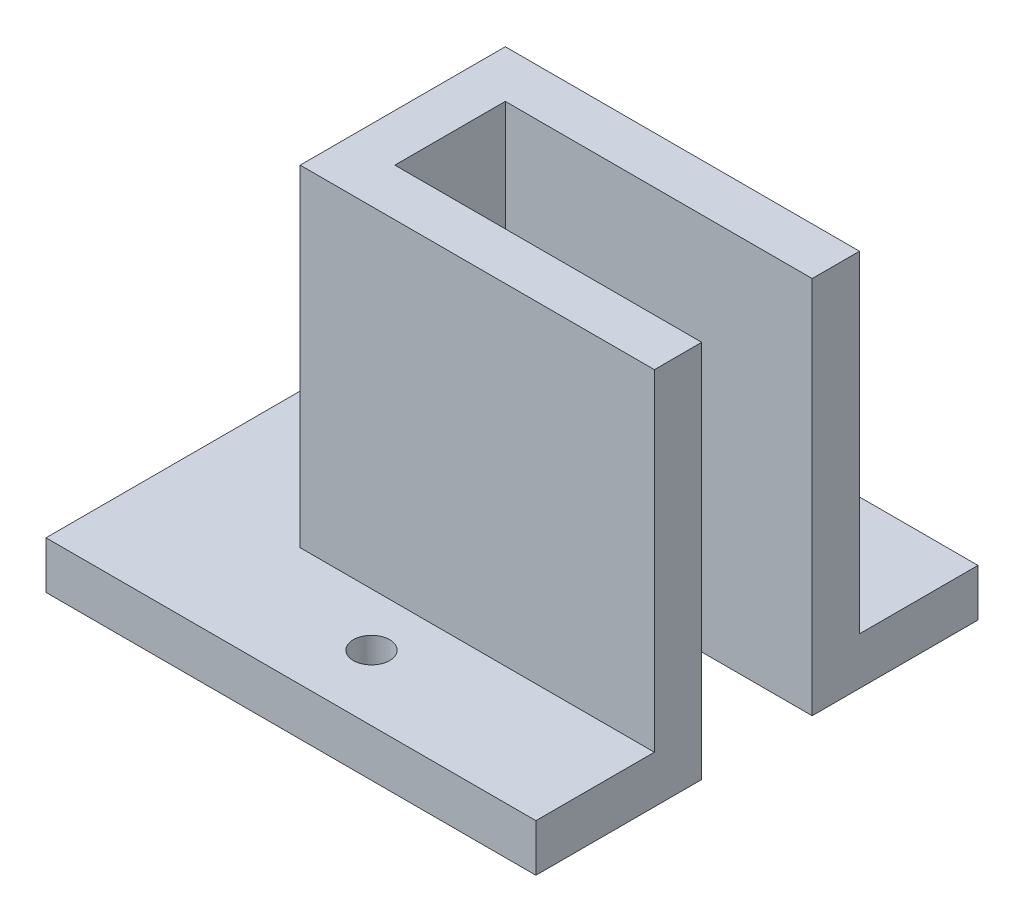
ISO-10303-21;
HEADER;
FILE_DESCRIPTION(('STEP AP214'),'2;1');
FILE_NAME('part.step','',(''),(''),'','','');
FILE_SCHEMA(('AUTOMOTIVE_DESIGN { 1 0 10303 214 1 1 1 1 }'));
ENDSEC;
DATA;
#1=APPLICATION_CONTEXT('core data for automotive mechanical design processes');
#2=APPLICATION_PROTOCOL_DEFINITION('international standard','automotive_design',2000,#1);
#3=PRODUCT_CONTEXT('',#1,'mechanical');
#4=PRODUCT('Part','Part','',(#3));
#5=PRODUCT_RELATED_PRODUCT_CATEGORY('part','',(#4));
#6=PRODUCT_DEFINITION_FORMATION('','',#4);
#7=PRODUCT_DEFINITION_CONTEXT('part definition',#1,'design');
#8=PRODUCT_DEFINITION('design','',#6,#7);
#9=PRODUCT_DEFINITION_SHAPE('','',#8);
#10=(LENGTH_UNIT() NAMED_UNIT(*) SI_UNIT(.MILLI.,.METRE.));
#11=(NAMED_UNIT(*) PLANE_ANGLE_UNIT() SI_UNIT($,.RADIAN.));
#12=(NAMED_UNIT(*) SI_UNIT($,.STERADIAN.) SOLID_ANGLE_UNIT());
#13=UNCERTAINTY_MEASURE_WITH_UNIT(LENGTH_MEASURE(1.E-05),#10,'distance_accuracy_value','');
#14=(GEOMETRIC_REPRESENTATION_CONTEXT(3) GLOBAL_UNCERTAINTY_ASSIGNED_CONTEXT((#13)) GLOBAL_UNIT_ASSIGNED_CONTEXT((#10,
#11,#12)) REPRESENTATION_CONTEXT('',''));
#15=CARTESIAN_POINT('',(0.,0.,0.));
#16=DIRECTION('',(0.,0.,1.));
#17=DIRECTION('',(1.,0.,0.));
#18=AXIS2_PLACEMENT_3D('',#15,#16,#17);
#19=CARTESIAN_POINT('',(0.,24.,13.));
#20=DIRECTION('',(0.,0.,-1.));
#21=DIRECTION('',(-1.,0.,0.));
#22=AXIS2_PLACEMENT_3D('',#19,#20,#21);
#23=PLANE('',#22);
#24=DIRECTION('',(-1.,0.,0.));
#25=VECTOR('',#24,1.);
#26=CARTESIAN_POINT('',(-8.6,3.,13.));
#27=LINE('',#26,#25);
#28=CARTESIAN_POINT('',(22.45,3.,13.));
#29=VERTEX_POINT('',#28);
#30=CARTESIAN_POINT('',(0.,3.,13.));
#31=VERTEX_POINT('',#30);
#32=EDGE_CURVE('E69',#29,#31,#27,.T.);
#33=ORIENTED_EDGE('',*,*,#32,.F.);
#34=DIRECTION('',(0.,-1.,0.));
#35=VECTOR('',#34,1.);
#36=CARTESIAN_POINT('',(22.45,24.,13.));
#37=LINE('',#36,#35);
#38=CARTESIAN_POINT('',(22.45,24.,13.));
#39=VERTEX_POINT('',#38);
#40=EDGE_CURVE('E54',#39,#29,#37,.T.);
#41=ORIENTED_EDGE('',*,*,#40,.F.);
#42=DIRECTION('',(1.,0.,0.));
#43=VECTOR('',#42,1.);
#44=CARTESIAN_POINT('',(0.,24.,13.));
#45=LINE('',#44,#43);
#46=CARTESIAN_POINT('',(0.,24.,13.));
#47=VERTEX_POINT('',#46);
#48=EDGE_CURVE('E256',#47,#39,#45,.T.);
#49=ORIENTED_EDGE('',*,*,#48,.F.);
#50=DIRECTION('',(0.,-1.,0.));
#51=VECTOR('',#50,1.);
#52=CARTESIAN_POINT('',(0.,24.,13.));
#53=LINE('',#52,#51);
#54=EDGE_CURVE('E11',#47,#31,#53,.T.);
#55=ORIENTED_EDGE('',*,*,#54,.T.);
#56=EDGE_LOOP('',(#33,#41,#49,#55));
#57=FACE_BOUND('',#56,.T.);
#58=ADVANCED_FACE('F45',(#57),#23,.F.);
#59=CARTESIAN_POINT('',(0.,24.,0.));
#60=DIRECTION('',(1.,0.,0.));
#61=DIRECTION('',(0.,0.,-1.));
#62=AXIS2_PLACEMENT_3D('',#59,#60,#61);
#63=PLANE('',#62);
#64=DIRECTION('',(0.,0.,-1.));
#65=VECTOR('',#64,1.);
#66=CARTESIAN_POINT('',(0.,3.,0.));
#67=LINE('',#66,#65);
#68=CARTESIAN_POINT('',(0.,3.,0.));
#69=VERTEX_POINT('',#68);
#70=EDGE_CURVE('E209',#31,#69,#67,.T.);
#71=ORIENTED_EDGE('',*,*,#70,.F.);
#72=ORIENTED_EDGE('',*,*,#54,.F.);
#73=DIRECTION('',(0.,0.,1.));
#74=VECTOR('',#73,1.);
#75=CARTESIAN_POINT('',(0.,24.,0.));
#76=LINE('',#75,#74);
#77=CARTESIAN_POINT('',(0.,24.,0.));
#78=VERTEX_POINT('',#77);
#79=EDGE_CURVE('E252',#78,#47,#76,.T.);
#80=ORIENTED_EDGE('',*,*,#79,.F.);
#81=DIRECTION('',(0.,-1.,0.));
#82=VECTOR('',#81,1.);
#83=CARTESIAN_POINT('',(0.,24.,0.));
#84=LINE('',#83,#82);
#85=EDGE_CURVE('E268',#78,#69,#84,.T.);
#86=ORIENTED_EDGE('',*,*,#85,.T.);
#87=EDGE_LOOP('',(#71,#72,#80,#86));
#88=FACE_BOUND('',#87,.T.);
#89=ADVANCED_FACE('F47',(#88),#63,.F.);
#90=CARTESIAN_POINT('',(22.45,24.,0.));
#91=DIRECTION('',(-1.,0.,0.));
#92=DIRECTION('',(0.,0.,1.));
#93=AXIS2_PLACEMENT_3D('',#90,#91,#92);
#94=PLANE('',#93);
#95=DIRECTION('',(0.,-1.,0.));
#96=VECTOR('',#95,1.);
#97=CARTESIAN_POINT('',(22.45,24.,10.));
#98=LINE('',#97,#96);
#99=CARTESIAN_POINT('',(22.45,24.,10.));
#100=VERTEX_POINT('',#99);
#101=CARTESIAN_POINT('',(22.45,0.,10.));
#102=VERTEX_POINT('',#101);
#103=EDGE_CURVE('E248',#100,#102,#98,.T.);
#104=ORIENTED_EDGE('',*,*,#103,.F.);
#105=DIRECTION('',(0.,0.,-1.));
#106=VECTOR('',#105,1.);
#107=CARTESIAN_POINT('',(22.45,24.,0.));
#108=LINE('',#107,#106);
#109=EDGE_CURVE('E261',#39,#100,#108,.T.);
#110=ORIENTED_EDGE('',*,*,#109,.F.);
#111=ORIENTED_EDGE('',*,*,#40,.T.);
#112=DIRECTION('',(0.,0.,-1.));
#113=VECTOR('',#112,1.);
#114=CARTESIAN_POINT('',(22.45,3.,20.51));
#115=LINE('',#114,#113);
#116=CARTESIAN_POINT('',(22.45,3.,20.51));
#117=VERTEX_POINT('',#116);
#118=EDGE_CURVE('E199',#117,#29,#115,.T.);
#119=ORIENTED_EDGE('',*,*,#118,.F.);
#120=DIRECTION('',(0.,1.,0.));
#121=VECTOR('',#120,1.);
#122=CARTESIAN_POINT('',(22.45,0.,20.51));
#123=LINE('',#122,#121);
#124=CARTESIAN_POINT('',(22.45,0.,20.51));
#125=VERTEX_POINT('',#124);
#126=EDGE_CURVE('E193',#125,#117,#123,.T.);
#127=ORIENTED_EDGE('',*,*,#126,.F.);
#128=DIRECTION('',(0.,0.,-1.));
#129=VECTOR('',#128,1.);
#130=CARTESIAN_POINT('',(22.45,0.,0.));
#131=LINE('',#130,#129);
#132=EDGE_CURVE('E257',#125,#102,#131,.T.);
#133=ORIENTED_EDGE('',*,*,#132,.T.);
#134=EDGE_LOOP('',(#104,#110,#111,#119,#127,#133));
#135=FACE_BOUND('',#134,.T.);
#136=ADVANCED_FACE('F283',(#135),#94,.F.);
#137=CARTESIAN_POINT('',(0.,24.,0.));
#138=DIRECTION('',(0.,1.,0.));
#139=DIRECTION('',(0.,0.,1.));
#140=AXIS2_PLACEMENT_3D('',#137,#138,#139);
#141=PLANE('',#140);
#142=ORIENTED_EDGE('',*,*,#109,.T.);
#143=DIRECTION('',(1.,0.,0.));
#144=VECTOR('',#143,1.);
#145=CARTESIAN_POINT('',(0.,24.,10.));
#146=LINE('',#145,#144);
#147=CARTESIAN_POINT('',(3.,24.,10.));
#148=VERTEX_POINT('',#147);
#149=EDGE_CURVE('E217',#148,#100,#146,.T.);
#150=ORIENTED_EDGE('',*,*,#149,.F.);
#151=DIRECTION('',(0.,0.,1.));
#152=VECTOR('',#151,1.);
#153=CARTESIAN_POINT('',(3.,24.,0.));
#154=LINE('',#153,#152);
#155=CARTESIAN_POINT('',(3.,24.,3.));
#156=VERTEX_POINT('',#155);
#157=EDGE_CURVE('E225',#156,#148,#154,.T.);
#158=ORIENTED_EDGE('',*,*,#157,.F.);
#159=DIRECTION('',(1.,0.,0.));
#160=VECTOR('',#159,1.);
#161=CARTESIAN_POINT('',(0.,24.,3.));
#162=LINE('',#161,#160);
#163=CARTESIAN_POINT('',(22.45,24.,3.));
#164=VERTEX_POINT('',#163);
#165=EDGE_CURVE('E220',#156,#164,#162,.T.);
#166=ORIENTED_EDGE('',*,*,#165,.T.);
#167=CARTESIAN_POINT('',(22.45,24.,0.));
#168=VERTEX_POINT('',#167);
#169=EDGE_CURVE('E260',#164,#168,#108,.T.);
#170=ORIENTED_EDGE('',*,*,#169,.T.);
#171=DIRECTION('',(-1.,0.,0.));
#172=VECTOR('',#171,1.);
#173=CARTESIAN_POINT('',(0.,24.,0.));
#174=LINE('',#173,#172);
#175=EDGE_CURVE('E265',#168,#78,#174,.T.);
#176=ORIENTED_EDGE('',*,*,#175,.T.);
#177=ORIENTED_EDGE('',*,*,#79,.T.);
#178=ORIENTED_EDGE('',*,*,#48,.T.);
#179=EDGE_LOOP('',(#142,#150,#158,#166,#170,#176,#177,#178));
#180=FACE_BOUND('',#179,.T.);
#181=ADVANCED_FACE('F292',(#180),#141,.T.);
#182=CARTESIAN_POINT('',(0.,0.,0.));
#183=DIRECTION('',(0.,1.,0.));
#184=DIRECTION('',(0.,0.,1.));
#185=AXIS2_PLACEMENT_3D('',#182,#183,#184);
#186=PLANE('',#185);
#187=CARTESIAN_POINT('',(8.12,0.,-3.64));
#188=DIRECTION('',(0.,1.,0.));
#189=DIRECTION('',(0.,0.,1.));
#190=AXIS2_PLACEMENT_3D('',#187,#188,#189);
#191=CIRCLE('',#190,1.15);
#192=CARTESIAN_POINT('',(8.12,0.,-2.49));
#193=VERTEX_POINT('',#192);
#194=EDGE_CURVE('E176',#193,#193,#191,.T.);
#195=ORIENTED_EDGE('',*,*,#194,.T.);
#196=EDGE_LOOP('',(#195));
#197=FACE_BOUND('',#196,.T.);
#198=CARTESIAN_POINT('',(7.88,0.,16.36));
#199=DIRECTION('',(0.,1.,0.));
#200=DIRECTION('',(0.,0.,1.));
#201=AXIS2_PLACEMENT_3D('',#198,#199,#200);
#202=CIRCLE('',#201,1.15);
#203=CARTESIAN_POINT('',(7.88,0.,17.51));
#204=VERTEX_POINT('',#203);
#205=EDGE_CURVE('E180',#204,#204,#202,.T.);
#206=ORIENTED_EDGE('',*,*,#205,.T.);
#207=EDGE_LOOP('',(#206));
#208=FACE_BOUND('',#207,.T.);
#209=CARTESIAN_POINT('',(-4.25,0.,6.22));
#210=DIRECTION('',(0.,1.,0.));
#211=DIRECTION('',(0.,0.,1.));
#212=AXIS2_PLACEMENT_3D('',#209,#210,#211);
#213=CIRCLE('',#212,1.15);
#214=CARTESIAN_POINT('',(-4.25,0.,7.37));
#215=VERTEX_POINT('',#214);
#216=EDGE_CURVE('E205',#215,#215,#213,.T.);
#217=ORIENTED_EDGE('',*,*,#216,.T.);
#218=EDGE_LOOP('',(#217));
#219=FACE_BOUND('',#218,.T.);
#220=DIRECTION('',(1.,0.,0.));
#221=VECTOR('',#220,1.);
#222=CARTESIAN_POINT('',(0.,0.,10.));
#223=LINE('',#222,#221);
#224=CARTESIAN_POINT('',(3.,0.,10.));
#225=VERTEX_POINT('',#224);
#226=EDGE_CURVE('E148',#225,#102,#223,.T.);
#227=ORIENTED_EDGE('',*,*,#226,.T.);
#228=ORIENTED_EDGE('',*,*,#132,.F.);
#229=DIRECTION('',(1.,0.,0.));
#230=VECTOR('',#229,1.);
#231=CARTESIAN_POINT('',(-8.6,0.,20.51));
#232=LINE('',#231,#230);
#233=CARTESIAN_POINT('',(-8.6,0.,20.51));
#234=VERTEX_POINT('',#233);
#235=EDGE_CURVE('E189',#234,#125,#232,.T.);
#236=ORIENTED_EDGE('',*,*,#235,.F.);
#237=DIRECTION('',(0.,0.,1.));
#238=VECTOR('',#237,1.);
#239=CARTESIAN_POINT('',(-8.6,0.,0.));
#240=LINE('',#239,#238);
#241=CARTESIAN_POINT('',(-8.6,0.,-7.51));
#242=VERTEX_POINT('',#241);
#243=EDGE_CURVE('E149',#242,#234,#240,.T.);
#244=ORIENTED_EDGE('',*,*,#243,.F.);
#245=DIRECTION('',(1.,0.,0.));
#246=VECTOR('',#245,1.);
#247=CARTESIAN_POINT('',(-8.6,0.,-7.51));
#248=LINE('',#247,#246);
#249=CARTESIAN_POINT('',(22.45,0.,-7.51));
#250=VERTEX_POINT('',#249);
#251=EDGE_CURVE('E158',#242,#250,#248,.T.);
#252=ORIENTED_EDGE('',*,*,#251,.T.);
#253=CARTESIAN_POINT('',(22.45,0.,3.));
#254=VERTEX_POINT('',#253);
#255=EDGE_CURVE('E251',#254,#250,#131,.T.);
#256=ORIENTED_EDGE('',*,*,#255,.F.);
#257=DIRECTION('',(1.,0.,0.));
#258=VECTOR('',#257,1.);
#259=CARTESIAN_POINT('',(0.,0.,3.));
#260=LINE('',#259,#258);
#261=CARTESIAN_POINT('',(3.,0.,3.));
#262=VERTEX_POINT('',#261);
#263=EDGE_CURVE('E232',#262,#254,#260,.T.);
#264=ORIENTED_EDGE('',*,*,#263,.F.);
#265=DIRECTION('',(0.,0.,1.));
#266=VECTOR('',#265,1.);
#267=CARTESIAN_POINT('',(3.,0.,0.));
#268=LINE('',#267,#266);
#269=EDGE_CURVE('E221',#262,#225,#268,.T.);
#270=ORIENTED_EDGE('',*,*,#269,.T.);
#271=EDGE_LOOP('',(#227,#228,#236,#244,#252,#256,#264,#270));
#272=FACE_BOUND('',#271,.T.);
#273=ADVANCED_FACE('F301',(#197,#208,#219,#272),#186,.F.);
#274=ORIENTED_EDGE('',*,*,#169,.F.);
#275=DIRECTION('',(0.,-1.,0.));
#276=VECTOR('',#275,1.);
#277=CARTESIAN_POINT('',(22.45,24.,3.));
#278=LINE('',#277,#276);
#279=EDGE_CURVE('E244',#164,#254,#278,.T.);
#280=ORIENTED_EDGE('',*,*,#279,.T.);
#281=ORIENTED_EDGE('',*,*,#255,.T.);
#282=DIRECTION('',(0.,1.,0.));
#283=VECTOR('',#282,1.);
#284=CARTESIAN_POINT('',(22.45,0.,-7.51));
#285=LINE('',#284,#283);
#286=CARTESIAN_POINT('',(22.45,3.,-7.51));
#287=VERTEX_POINT('',#286);
#288=EDGE_CURVE('E166',#250,#287,#285,.T.);
#289=ORIENTED_EDGE('',*,*,#288,.T.);
#290=DIRECTION('',(0.,0.,1.));
#291=VECTOR('',#290,1.);
#292=CARTESIAN_POINT('',(22.45,3.,-7.51));
#293=LINE('',#292,#291);
#294=CARTESIAN_POINT('',(22.45,3.,0.));
#295=VERTEX_POINT('',#294);
#296=EDGE_CURVE('E164',#287,#295,#293,.T.);
#297=ORIENTED_EDGE('',*,*,#296,.T.);
#298=DIRECTION('',(0.,-1.,0.));
#299=VECTOR('',#298,1.);
#300=CARTESIAN_POINT('',(22.45,24.,0.));
#301=LINE('',#300,#299);
#302=EDGE_CURVE('E61',#168,#295,#301,.T.);
#303=ORIENTED_EDGE('',*,*,#302,.F.);
#304=EDGE_LOOP('',(#274,#280,#281,#289,#297,#303));
#305=FACE_BOUND('',#304,.T.);
#306=ADVANCED_FACE('F298',(#305),#94,.F.);
#307=CARTESIAN_POINT('',(0.,24.,0.));
#308=DIRECTION('',(0.,0.,1.));
#309=DIRECTION('',(1.,0.,0.));
#310=AXIS2_PLACEMENT_3D('',#307,#308,#309);
#311=PLANE('',#310);
#312=ORIENTED_EDGE('',*,*,#302,.T.);
#313=DIRECTION('',(-1.,0.,0.));
#314=VECTOR('',#313,1.);
#315=CARTESIAN_POINT('',(-8.6,3.,0.));
#316=LINE('',#315,#314);
#317=EDGE_CURVE('E160',#295,#69,#316,.T.);
#318=ORIENTED_EDGE('',*,*,#317,.T.);
#319=ORIENTED_EDGE('',*,*,#85,.F.);
#320=ORIENTED_EDGE('',*,*,#175,.F.);
#321=EDGE_LOOP('',(#312,#318,#319,#320));
#322=FACE_BOUND('',#321,.T.);
#323=ADVANCED_FACE('F290',(#322),#311,.F.);
#324=CARTESIAN_POINT('',(0.,24.,10.));
#325=DIRECTION('',(0.,0.,-1.));
#326=DIRECTION('',(-1.,0.,0.));
#327=AXIS2_PLACEMENT_3D('',#324,#325,#326);
#328=PLANE('',#327);
#329=ORIENTED_EDGE('',*,*,#226,.F.);
#330=DIRECTION('',(0.,-1.,0.));
#331=VECTOR('',#330,1.);
#332=CARTESIAN_POINT('',(3.,24.,10.));
#333=LINE('',#332,#331);
#334=EDGE_CURVE('E228',#148,#225,#333,.T.);
#335=ORIENTED_EDGE('',*,*,#334,.F.);
#336=ORIENTED_EDGE('',*,*,#149,.T.);
#337=ORIENTED_EDGE('',*,*,#103,.T.);
#338=EDGE_LOOP('',(#329,#335,#336,#337));
#339=FACE_BOUND('',#338,.T.);
#340=ADVANCED_FACE('F309',(#339),#328,.T.);
#341=CARTESIAN_POINT('',(0.,24.,3.));
#342=DIRECTION('',(0.,0.,-1.));
#343=DIRECTION('',(-1.,0.,0.));
#344=AXIS2_PLACEMENT_3D('',#341,#342,#343);
#345=PLANE('',#344);
#346=ORIENTED_EDGE('',*,*,#263,.T.);
#347=ORIENTED_EDGE('',*,*,#279,.F.);
#348=ORIENTED_EDGE('',*,*,#165,.F.);
#349=DIRECTION('',(0.,-1.,0.));
#350=VECTOR('',#349,1.);
#351=CARTESIAN_POINT('',(3.,24.,3.));
#352=LINE('',#351,#350);
#353=EDGE_CURVE('E241',#156,#262,#352,.T.);
#354=ORIENTED_EDGE('',*,*,#353,.T.);
#355=EDGE_LOOP('',(#346,#347,#348,#354));
#356=FACE_BOUND('',#355,.T.);
#357=ADVANCED_FACE('F314',(#356),#345,.F.);
#358=CARTESIAN_POINT('',(3.,24.,0.));
#359=DIRECTION('',(1.,0.,0.));
#360=DIRECTION('',(0.,0.,-1.));
#361=AXIS2_PLACEMENT_3D('',#358,#359,#360);
#362=PLANE('',#361);
#363=ORIENTED_EDGE('',*,*,#269,.F.);
#364=ORIENTED_EDGE('',*,*,#353,.F.);
#365=ORIENTED_EDGE('',*,*,#157,.T.);
#366=ORIENTED_EDGE('',*,*,#334,.T.);
#367=EDGE_LOOP('',(#363,#364,#365,#366));
#368=FACE_BOUND('',#367,.T.);
#369=ADVANCED_FACE('F312',(#368),#362,.T.);
#370=CARTESIAN_POINT('',(-8.6,3.,0.));
#371=DIRECTION('',(0.,-1.,0.));
#372=DIRECTION('',(0.,0.,-1.));
#373=AXIS2_PLACEMENT_3D('',#370,#371,#372);
#374=PLANE('',#373);
#375=CARTESIAN_POINT('',(8.12,3.,-3.64));
#376=DIRECTION('',(0.,1.,0.));
#377=DIRECTION('',(0.,0.,1.));
#378=AXIS2_PLACEMENT_3D('',#375,#376,#377);
#379=CIRCLE('',#378,1.15);
#380=CARTESIAN_POINT('',(8.12,3.,-2.49));
#381=VERTEX_POINT('',#380);
#382=EDGE_CURVE('E505',#381,#381,#379,.T.);
#383=ORIENTED_EDGE('',*,*,#382,.F.);
#384=EDGE_LOOP('',(#383));
#385=FACE_BOUND('',#384,.T.);
#386=CARTESIAN_POINT('',(7.88,3.,16.36));
#387=DIRECTION('',(0.,1.,0.));
#388=DIRECTION('',(0.,0.,1.));
#389=AXIS2_PLACEMENT_3D('',#386,#387,#388);
#390=CIRCLE('',#389,1.15);
#391=CARTESIAN_POINT('',(7.88,3.,17.51));
#392=VERTEX_POINT('',#391);
#393=EDGE_CURVE('E179',#392,#392,#390,.T.);
#394=ORIENTED_EDGE('',*,*,#393,.F.);
#395=EDGE_LOOP('',(#394));
#396=FACE_BOUND('',#395,.T.);
#397=CARTESIAN_POINT('',(-4.25,3.,6.22));
#398=DIRECTION('',(0.,1.,0.));
#399=DIRECTION('',(0.,0.,1.));
#400=AXIS2_PLACEMENT_3D('',#397,#398,#399);
#401=CIRCLE('',#400,1.15);
#402=CARTESIAN_POINT('',(-4.25,3.,7.37));
#403=VERTEX_POINT('',#402);
#404=EDGE_CURVE('E204',#403,#403,#401,.T.);
#405=ORIENTED_EDGE('',*,*,#404,.F.);
#406=EDGE_LOOP('',(#405));
#407=FACE_BOUND('',#406,.T.);
#408=ORIENTED_EDGE('',*,*,#70,.T.);
#409=ORIENTED_EDGE('',*,*,#317,.F.);
#410=ORIENTED_EDGE('',*,*,#296,.F.);
#411=DIRECTION('',(-1.,0.,0.));
#412=VECTOR('',#411,1.);
#413=CARTESIAN_POINT('',(-8.6,3.,-7.51));
#414=LINE('',#413,#412);
#415=CARTESIAN_POINT('',(-8.6,3.,-7.51));
#416=VERTEX_POINT('',#415);
#417=EDGE_CURVE('E155',#287,#416,#414,.T.);
#418=ORIENTED_EDGE('',*,*,#417,.T.);
#419=DIRECTION('',(0.,0.,-1.));
#420=VECTOR('',#419,1.);
#421=CARTESIAN_POINT('',(-8.6,3.,0.));
#422=LINE('',#421,#420);
#423=CARTESIAN_POINT('',(-8.6,3.,20.51));
#424=VERTEX_POINT('',#423);
#425=EDGE_CURVE('E137',#424,#416,#422,.T.);
#426=ORIENTED_EDGE('',*,*,#425,.F.);
#427=DIRECTION('',(-1.,0.,0.));
#428=VECTOR('',#427,1.);
#429=CARTESIAN_POINT('',(-8.6,3.,20.51));
#430=LINE('',#429,#428);
#431=EDGE_CURVE('E196',#117,#424,#430,.T.);
#432=ORIENTED_EDGE('',*,*,#431,.F.);
#433=ORIENTED_EDGE('',*,*,#118,.T.);
#434=ORIENTED_EDGE('',*,*,#32,.T.);
#435=EDGE_LOOP('',(#408,#409,#410,#418,#426,#432,#433,#434));
#436=FACE_BOUND('',#435,.T.);
#437=ADVANCED_FACE('F162',(#385,#396,#407,#436),#374,.F.);
#438=CARTESIAN_POINT('',(-8.6,0.,0.));
#439=DIRECTION('',(1.,0.,0.));
#440=DIRECTION('',(0.,0.,-1.));
#441=AXIS2_PLACEMENT_3D('',#438,#439,#440);
#442=PLANE('',#441);
#443=ORIENTED_EDGE('',*,*,#425,.T.);
#444=DIRECTION('',(0.,-1.,0.));
#445=VECTOR('',#444,1.);
#446=CARTESIAN_POINT('',(-8.6,0.,-7.51));
#447=LINE('',#446,#445);
#448=EDGE_CURVE('E140',#416,#242,#447,.T.);
#449=ORIENTED_EDGE('',*,*,#448,.T.);
#450=ORIENTED_EDGE('',*,*,#243,.T.);
#451=DIRECTION('',(0.,-1.,0.));
#452=VECTOR('',#451,1.);
#453=CARTESIAN_POINT('',(-8.6,0.,20.51));
#454=LINE('',#453,#452);
#455=EDGE_CURVE('E143',#424,#234,#454,.T.);
#456=ORIENTED_EDGE('',*,*,#455,.F.);
#457=EDGE_LOOP('',(#443,#449,#450,#456));
#458=FACE_BOUND('',#457,.T.);
#459=ADVANCED_FACE('F139',(#458),#442,.F.);
#460=CARTESIAN_POINT('',(-4.25,0.,6.22));
#461=DIRECTION('',(0.,1.,0.));
#462=DIRECTION('',(0.,0.,1.));
#463=AXIS2_PLACEMENT_3D('',#460,#461,#462);
#464=CYLINDRICAL_SURFACE('',#463,1.15);
#465=ORIENTED_EDGE('',*,*,#216,.F.);
#466=EDGE_LOOP('',(#465));
#467=FACE_BOUND('',#466,.T.);
#468=ORIENTED_EDGE('',*,*,#404,.T.);
#469=EDGE_LOOP('',(#468));
#470=FACE_BOUND('',#469,.T.);
#471=ADVANCED_FACE('F354',(#467,#470),#464,.F.);
#472=CARTESIAN_POINT('',(0.,0.,20.51));
#473=DIRECTION('',(0.,0.,-1.));
#474=DIRECTION('',(-1.,0.,0.));
#475=AXIS2_PLACEMENT_3D('',#472,#473,#474);
#476=PLANE('',#475);
#477=ORIENTED_EDGE('',*,*,#455,.T.);
#478=ORIENTED_EDGE('',*,*,#235,.T.);
#479=ORIENTED_EDGE('',*,*,#126,.T.);
#480=ORIENTED_EDGE('',*,*,#431,.T.);
#481=EDGE_LOOP('',(#477,#478,#479,#480));
#482=FACE_BOUND('',#481,.T.);
#483=ADVANCED_FACE('F305',(#482),#476,.F.);
#484=CARTESIAN_POINT('',(7.88,0.,16.36));
#485=DIRECTION('',(0.,1.,0.));
#486=DIRECTION('',(0.,0.,1.));
#487=AXIS2_PLACEMENT_3D('',#484,#485,#486);
#488=CYLINDRICAL_SURFACE('',#487,1.15);
#489=CARTESIAN_POINT('',(7.88,0.,17.51));
#490=CARTESIAN_POINT('',(7.88,0.0312499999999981,17.51));
#491=CARTESIAN_POINT('',(7.88,0.0624999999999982,17.51));
#492=CARTESIAN_POINT('',(7.88,0.124999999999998,17.51));
#493=CARTESIAN_POINT('',(7.88,0.156249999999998,17.51));
#494=CARTESIAN_POINT('',(7.88,0.218749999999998,17.51));
#495=CARTESIAN_POINT('',(7.88,0.249999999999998,17.51));
#496=CARTESIAN_POINT('',(7.88,0.312499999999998,17.51));
#497=CARTESIAN_POINT('',(7.88,0.343749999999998,17.51));
#498=CARTESIAN_POINT('',(7.88,0.406249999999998,17.51));
#499=CARTESIAN_POINT('',(7.88,0.437499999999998,17.51));
#500=CARTESIAN_POINT('',(7.88,0.499999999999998,17.51));
#501=CARTESIAN_POINT('',(7.88,0.531249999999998,17.51));
#502=CARTESIAN_POINT('',(7.88,0.593749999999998,17.51));
#503=CARTESIAN_POINT('',(7.88,0.624999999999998,17.51));
#504=CARTESIAN_POINT('',(7.88,0.687499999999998,17.51));
#505=CARTESIAN_POINT('',(7.88,0.718749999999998,17.51));
#506=CARTESIAN_POINT('',(7.88,0.781249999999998,17.51));
#507=CARTESIAN_POINT('',(7.88,0.812499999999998,17.51));
#508=CARTESIAN_POINT('',(7.88,0.874999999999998,17.51));
#509=CARTESIAN_POINT('',(7.88,0.906249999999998,17.51));
#510=CARTESIAN_POINT('',(7.88,0.968749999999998,17.51));
#511=CARTESIAN_POINT('',(7.88,0.999999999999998,17.51));
#512=CARTESIAN_POINT('',(7.88,1.0625,17.51));
#513=CARTESIAN_POINT('',(7.88,1.09375,17.51));
#514=CARTESIAN_POINT('',(7.88,1.15625,17.51));
#515=CARTESIAN_POINT('',(7.88,1.1875,17.51));
#516=CARTESIAN_POINT('',(7.88,1.25,17.51));
#517=CARTESIAN_POINT('',(7.88,1.28125,17.51));
#518=CARTESIAN_POINT('',(7.88,1.34375,17.51));
#519=CARTESIAN_POINT('',(7.88,1.375,17.51));
#520=CARTESIAN_POINT('',(7.88,1.4375,17.51));
#521=CARTESIAN_POINT('',(7.88,1.46875,17.51));
#522=CARTESIAN_POINT('',(7.88,1.53125,17.51));
#523=CARTESIAN_POINT('',(7.88,1.5625,17.51));
#524=CARTESIAN_POINT('',(7.88,1.625,17.51));
#525=CARTESIAN_POINT('',(7.88,1.65625,17.51));
#526=CARTESIAN_POINT('',(7.88,1.71875,17.51));
#527=CARTESIAN_POINT('',(7.88,1.75,17.51));
#528=CARTESIAN_POINT('',(7.88,1.8125,17.51));
#529=CARTESIAN_POINT('',(7.88,1.84375,17.51));
#530=CARTESIAN_POINT('',(7.88,1.90625,17.51));
#531=CARTESIAN_POINT('',(7.88,1.9375,17.51));
#532=CARTESIAN_POINT('',(7.88,2.,17.51));
#533=CARTESIAN_POINT('',(7.88,2.03125,17.51));
#534=CARTESIAN_POINT('',(7.88,2.09375,17.51));
#535=CARTESIAN_POINT('',(7.88,2.125,17.51));
#536=CARTESIAN_POINT('',(7.88,2.1875,17.51));
#537=CARTESIAN_POINT('',(7.88,2.21875,17.51));
#538=CARTESIAN_POINT('',(7.88,2.28125,17.51));
#539=CARTESIAN_POINT('',(7.88,2.3125,17.51));
#540=CARTESIAN_POINT('',(7.88,2.375,17.51));
#541=CARTESIAN_POINT('',(7.88,2.40625,17.51));
#542=CARTESIAN_POINT('',(7.88,2.46875,17.51));
#543=CARTESIAN_POINT('',(7.88,2.5,17.51));
#544=CARTESIAN_POINT('',(7.88,2.5625,17.51));
#545=CARTESIAN_POINT('',(7.88,2.59375,17.51));
#546=CARTESIAN_POINT('',(7.88,2.65625,17.51));
#547=CARTESIAN_POINT('',(7.88,2.6875,17.51));
#548=CARTESIAN_POINT('',(7.88,2.75,17.51));
#549=CARTESIAN_POINT('',(7.88,2.78125,17.51));
#550=CARTESIAN_POINT('',(7.88,2.84375,17.51));
#551=CARTESIAN_POINT('',(7.88,2.875,17.51));
#552=CARTESIAN_POINT('',(7.88,2.9375,17.51));
#553=CARTESIAN_POINT('',(7.88,2.96875,17.51));
#554=CARTESIAN_POINT('',(7.88,3.,17.51));
#555=B_SPLINE_CURVE_WITH_KNOTS('',3,(#489,#490,#491,#492,#493,#494,#495,#496,#497,#498,#499,
#500,#501,#502,#503,#504,#505,#506,#507,#508,#509,#510,#511,#512,#513,#514,#515,#516,#517,#518,
#519,#520,#521,#522,#523,#524,#525,#526,#527,#528,#529,#530,#531,#532,#533,#534,#535,#536,#537,
#538,#539,#540,#541,#542,#543,#544,#545,#546,#547,#548,#549,#550,#551,#552,#553,#554),
.UNSPECIFIED.,.F.,.F.,(4,2,2,2,2,2,2,2,2,2,2,2,2,2,2,2,2,2,2,2,2,2,2,2,2,2,2,2,2,2,2,2,4),(0.,
0.09375,0.1875,0.28125,0.375,0.46875,0.5625,0.65625,0.75,0.84375,0.9375,1.03125,1.125,1.21875,
1.3125,1.40625,1.5,1.59375,1.6875,1.78125,1.875,1.96875,2.0625,2.15625,2.25,2.34375,2.4375,
2.53125,2.625,2.71875,2.8125,2.90625,3.),.UNSPECIFIED.);
#556=EDGE_CURVE('BSEAM353',#204,#392,#555,.T.);
#557=ORIENTED_EDGE('',*,*,#205,.F.);
#558=ORIENTED_EDGE('',*,*,#393,.T.);
#559=ORIENTED_EDGE('',*,*,#556,.T.);
#560=ORIENTED_EDGE('',*,*,#556,.F.);
#561=EDGE_LOOP('',(#557,#559,#558,#560));
#562=FACE_BOUND('',#561,.T.);
#563=ADVANCED_FACE('F353',(#562),#488,.F.);
#564=CARTESIAN_POINT('',(0.,0.,-7.51));
#565=DIRECTION('',(0.,0.,1.));
#566=DIRECTION('',(-1.,0.,0.));
#567=AXIS2_PLACEMENT_3D('',#564,#565,#566);
#568=PLANE('',#567);
#569=ORIENTED_EDGE('',*,*,#448,.F.);
#570=ORIENTED_EDGE('',*,*,#417,.F.);
#571=ORIENTED_EDGE('',*,*,#288,.F.);
#572=ORIENTED_EDGE('',*,*,#251,.F.);
#573=EDGE_LOOP('',(#569,#570,#571,#572));
#574=FACE_BOUND('',#573,.T.);
#575=ADVANCED_FACE('F153',(#574),#568,.F.);
#576=CARTESIAN_POINT('',(8.12,0.,-3.64));
#577=DIRECTION('',(0.,1.,0.));
#578=DIRECTION('',(0.,0.,1.));
#579=AXIS2_PLACEMENT_3D('',#576,#577,#578);
#580=CYLINDRICAL_SURFACE('',#579,1.15);
#581=ORIENTED_EDGE('',*,*,#194,.F.);
#582=EDGE_LOOP('',(#581));
#583=FACE_BOUND('',#582,.T.);
#584=ORIENTED_EDGE('',*,*,#382,.T.);
#585=EDGE_LOOP('',(#584));
#586=FACE_BOUND('',#585,.T.);
#587=ADVANCED_FACE('F390',(#583,#586),#580,.F.);
#588=CLOSED_SHELL('',(#58,#89,#136,#181,#273,#306,#323,#340,#357,#369,#437,#459,#471,#483,#563,
#575,#587));
#589=MANIFOLD_SOLID_BREP('B2',#588);
#590=ADVANCED_BREP_SHAPE_REPRESENTATION('',(#18,#589),#14);
#591=SHAPE_DEFINITION_REPRESENTATION(#9,#590);
ENDSEC;
END-ISO-10303-21;
